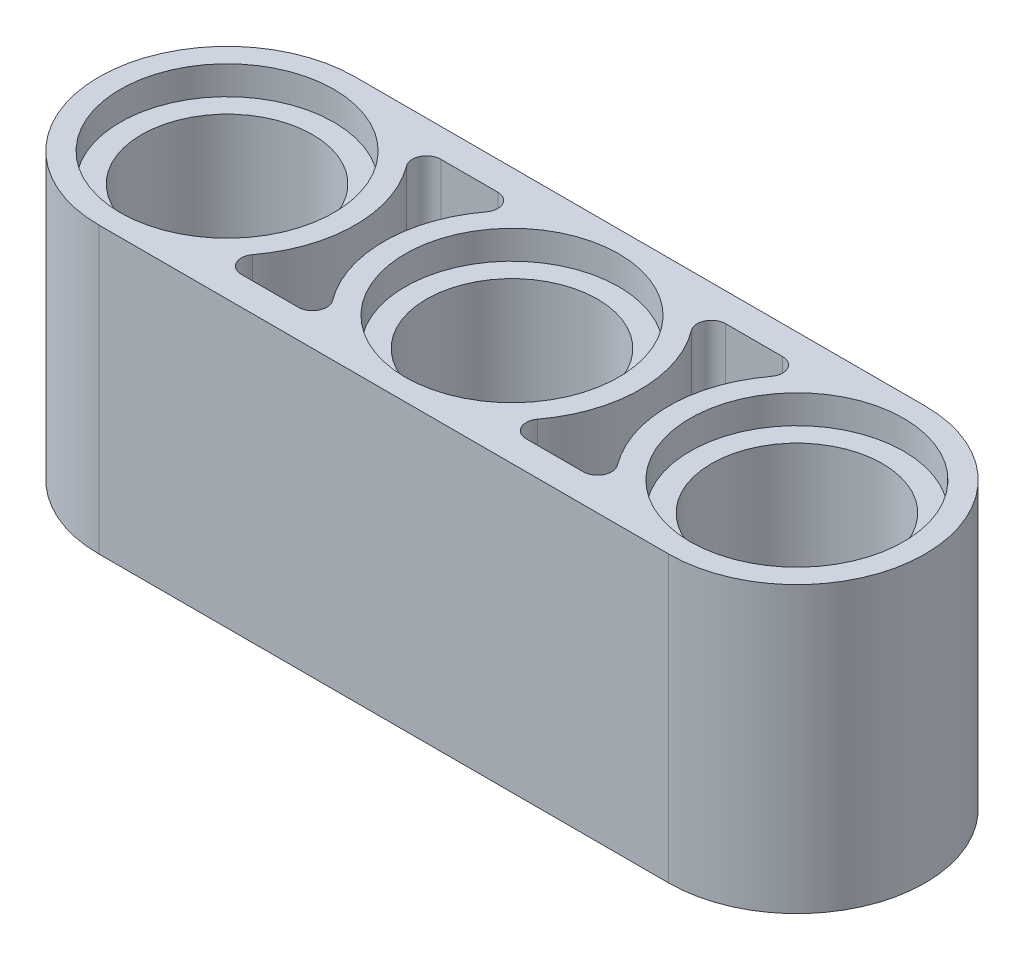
from build123d import *

# Parameters (mm, degrees)
SKETCH1_R           = 2.4
BOSS_EXTRUDE1_DEPTH = 8
SKETCH6_R           = 3
CUT_EXTRUDE4_DEPTH  = 0.8
CUT_EXTRUDE5_START  = -3.2
CUT_EXTRUDE5_DEPTH  = 3.2
CUT_EXTRUDE6_DEPTH  = 8


with BuildPart() as part:
    # Sketch1 → Boss-Extrude1 (new body)
    with BuildSketch(Plane(origin=(0, 0, 0), x_dir=(1, 0, 0), z_dir=(0, 1, 0))):
        with BuildLine():
            Line((0, 3.6), (32, 3.6))
            ThreePointArc((32, 3.6), (35.6, 0), (32, -3.6))
            Line((32, -3.6), (0, -3.6))
            ThreePointArc((0, -3.6), (-3.6, 0), (0, 3.6))
        make_face()
        with Locations(Location((0, 0, 0), (0, 0, 270))):
            Circle(SKETCH1_R, mode=Mode.SUBTRACT)
        with Locations(Location((8, 0, 0), (0, 0, 270))):
            Circle(SKETCH1_R, mode=Mode.SUBTRACT)
        with Locations(Location((16, 0, 0), (0, 0, 270))):
            Circle(SKETCH1_R, mode=Mode.SUBTRACT)
        with Locations(Location((24, 0, 0), (0, 0, 270))):
            Circle(SKETCH1_R, mode=Mode.SUBTRACT)
        with Locations(Location((32, 0, 0), (0, 0, 270))):
            Circle(SKETCH1_R, mode=Mode.SUBTRACT)
    extrude(amount=BOSS_EXTRUDE1_DEPTH)

    # Sketch6 → Cut-Extrude4 (cut)
    with BuildSketch(Plane(origin=(0, 8, 0), x_dir=(1, 0, 0), z_dir=(0, 1, 0))):
        with Locations(Location((0, 0, 0), (0, 0, 270))):
            Circle(SKETCH6_R)
        with Locations(Location((8, 0, 0), (0, 0, 270))):
            Circle(SKETCH6_R)
        with Locations(Location((16, 0, 0), (0, 0, 270))):
            Circle(SKETCH6_R)
        with Locations(Location((24, 0, 0), (0, 0, 270))):
            Circle(SKETCH6_R)
        with Locations(Location((32, 0, 0), (0, 0, 270))):
            Circle(SKETCH6_R)
    cut_extrude4 = extrude(amount=-CUT_EXTRUDE4_DEPTH, mode=Mode.SUBTRACT)

    # Sketch7 → Cut-Extrude5 (cut)
    with BuildSketch(Plane(origin=(0, 8, 0), x_dir=(1, 0, 0), z_dir=(0, 1, 0)).offset(CUT_EXTRUDE5_START)):
        with BuildLine():
            Line((3.2, 2.8), (4.8, 2.8))
            ThreePointArc((4.8, 2.8), (5.157770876, 2.578885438), (5.12, 2.16))
            ThreePointArc((5.12, 2.16), (4.4, 0), (5.12, -2.16))
            ThreePointArc((5.12, -2.16), (5.157770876, -2.578885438), (4.8, -2.8))
            Line((4.8, -2.8), (3.2, -2.8))
            ThreePointArc((3.2, -2.8), (2.842229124, -2.578885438), (2.88, -2.16))
            ThreePointArc((2.88, -2.16), (3.6, 0), (2.88, 2.16))
            ThreePointArc((2.88, 2.16), (2.842229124, 2.578885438), (3.2, 2.8))
        make_face()
        with BuildLine():
            Line((11.2, 2.8), (12.8, 2.8))
            ThreePointArc((12.8, 2.8), (13.157770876, 2.578885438), (13.12, 2.16))
            ThreePointArc((13.12, 2.16), (12.4, 0), (13.12, -2.16))
            ThreePointArc((13.12, -2.16), (13.157770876, -2.578885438), (12.8, -2.8))
            Line((12.8, -2.8), (11.2, -2.8))
            ThreePointArc((11.2, -2.8), (10.842229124, -2.578885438), (10.88, -2.16))
            ThreePointArc((10.88, -2.16), (11.6, 0), (10.88, 2.16))
            ThreePointArc((10.88, 2.16), (10.842229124, 2.578885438), (11.2, 2.8))
        make_face()
        with BuildLine():
            Line((19.2, 2.8), (20.8, 2.8))
            ThreePointArc((20.8, 2.8), (21.157770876, 2.578885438), (21.12, 2.16))
            ThreePointArc((21.12, 2.16), (20.4, 0), (21.12, -2.16))
            ThreePointArc((21.12, -2.16), (21.157770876, -2.578885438), (20.8, -2.8))
            Line((20.8, -2.8), (19.2, -2.8))
            ThreePointArc((19.2, -2.8), (18.842229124, -2.578885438), (18.88, -2.16))
            ThreePointArc((18.88, -2.16), (19.6, 0), (18.88, 2.16))
            ThreePointArc((18.88, 2.16), (18.842229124, 2.578885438), (19.2, 2.8))
        make_face()
        with BuildLine():
            Line((27.2, 2.8), (28.8, 2.8))
            ThreePointArc((28.8, 2.8), (29.157770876, 2.578885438), (29.12, 2.16))
            ThreePointArc((29.12, 2.16), (28.4, 0), (29.12, -2.16))
            ThreePointArc((29.12, -2.16), (29.157770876, -2.578885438), (28.8, -2.8))
            Line((28.8, -2.8), (27.2, -2.8))
            ThreePointArc((27.2, -2.8), (26.842229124, -2.578885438), (26.88, -2.16))
            ThreePointArc((26.88, -2.16), (27.6, 0), (26.88, 2.16))
            ThreePointArc((26.88, 2.16), (26.842229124, 2.578885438), (27.2, 2.8))
        make_face()
    cut_extrude5 = extrude(amount=CUT_EXTRUDE5_DEPTH, mode=Mode.SUBTRACT)

    # Mirror2: Cut-Extrude4, Cut-Extrude5 across plane
    add(cut_extrude4.mirror(Plane.ZX.offset(4)), mode=Mode.SUBTRACT)
    add(cut_extrude5.mirror(Plane.ZX.offset(4)), mode=Mode.SUBTRACT)

    # Sketch8 → Cut-Extrude6 (cut)
    with BuildSketch(Plane.XZ):
        with BuildLine():
            Line((24, 3.6), (32, 3.6))
            ThreePointArc((32, 3.6), (35.6, 0), (32, -3.6))
            Line((32, -3.6), (24, -3.6))
            Line((24, -3.6), (16, -3.6))
            ThreePointArc((16, -3.6), (19.6, 0), (16, 3.6))
            Line((16, 3.6), (24, 3.6))
        make_face()
    extrude(amount=-CUT_EXTRUDE6_DEPTH, mode=Mode.SUBTRACT)


solid = part.part
